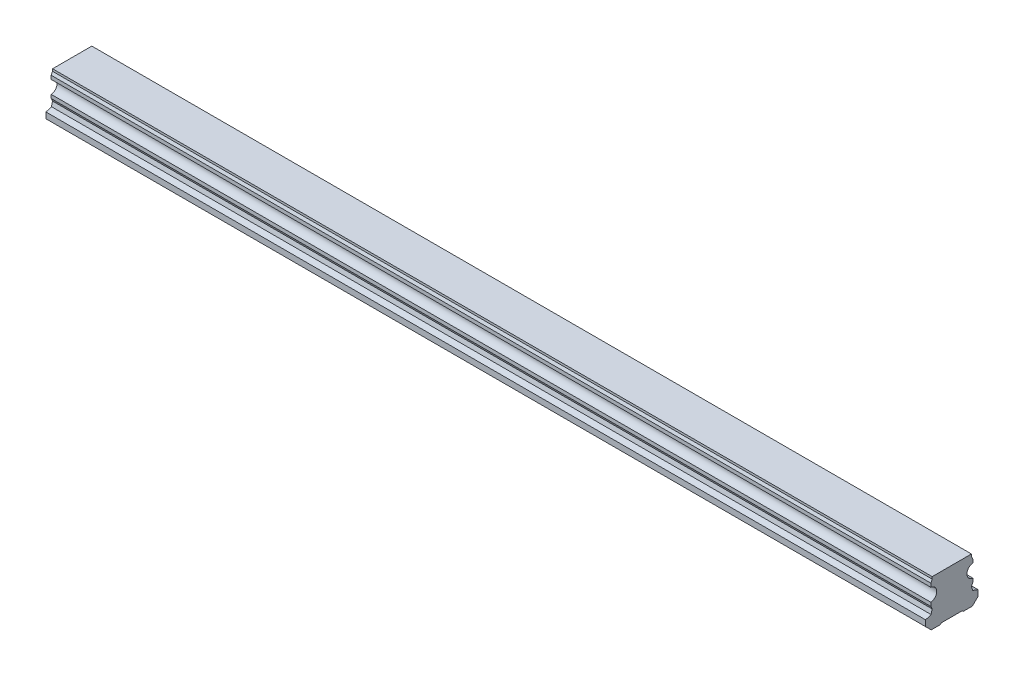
from build123d import *

# Parameters (mm, degrees)
BOSS_EXTRUDE1_DEPTH        = 420
SKETCH3_R                  = 3
SKETCH3_R_2                = 2.5
CUT_EXTRUDE3_DEPTH         = 12
SKETCH3_2_R                = 2.5
CUT_EXTRUDE4_DEPTH         = 15
CHAMFER1_SIZE              = 0.5
LPATTERN4_COUNT            = 7
LPATTERN4_PITCH            = 60
CHAMFER1_OF_LPATTERN4_SIZE = 0.5


with BuildPart() as part:
    # Sketch1 → Boss-Extrude1 (new body)
    with BuildSketch(Plane(origin=(0, 0, 0), x_dir=(0, 0, -1), z_dir=(1, 0, 0))):
        with BuildLine():
            Line((9.375, 21.8), (-9.375, 21.8))
            Line((-9.375, 21.8), (-9.375, 20.756))
            Line((-9.375, 20.756), (-10, 19.415683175))
            Line((-10, 19.415683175), (-10, 17.685449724))
            ThreePointArc((-10, 17.685449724), (-7.2, 14.6), (-10, 11.514550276))
            Line((-10, 11.514550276), (-10, 9.784316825))
            Line((-10, 9.784316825), (-9.375, 8.444))
            Line((-9.375, 8.444), (-9.922688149, 6.4))
            Line((-9.922688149, 6.4), (-12.5, 5.489338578))
            Line((-12.5, 5.489338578), (-12.5, 2.65))
            Line((-12.5, 2.65), (-9.85, 0))
            Line((-9.85, 0), (-5.5, 0))
            Line((-5.5, 0), (-5, 0.5))
            Line((-5, 0.5), (5, 0.5))
            Line((5, 0.5), (5.5, 0))
            Line((5.5, 0), (9.85, 0))
            Line((9.85, 0), (12.5, 2.65))
            Line((12.5, 2.65), (12.5, 5.489338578))
            Line((12.5, 5.489338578), (9.922688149, 6.4))
            Line((9.922688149, 6.4), (9.375, 8.444))
            Line((9.375, 8.444), (10, 9.784316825))
            Line((10, 9.784316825), (10, 11.514550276))
            ThreePointArc((10, 11.514550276), (7.2, 14.6), (10, 17.685449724))
            Line((10, 17.685449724), (10, 19.415683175))
            Line((10, 19.415683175), (9.375, 20.756))
            Line((9.375, 20.756), (9.375, 21.8))
        make_face()
    extrude(amount=BOSS_EXTRUDE1_DEPTH)

    # Sketch3 → Cut-Extrude3 (cut)
    with BuildSketch(Plane.XZ):
        with Locations(Location((30, 0, 0), (0, 0, 270))):
            Circle(SKETCH3_R)
        with Locations(Location((30, 0, 0), (0, 0, 270))):
            Circle(SKETCH3_R_2, mode=Mode.SUBTRACT)
    cut_extrude3 = extrude(amount=-CUT_EXTRUDE3_DEPTH, mode=Mode.SUBTRACT)

    # Sketch3_2 → Cut-Extrude4 (cut)
    with BuildSketch(Plane.XZ):
        with Locations(Location((30, 0, 0), (0, 0, 270))):
            Circle(SKETCH3_2_R)
    cut_extrude4 = extrude(amount=-CUT_EXTRUDE4_DEPTH, mode=Mode.SUBTRACT)

    # Cut-Extrude5 cone 1 section (on through the dimple's axis) → Cut-Extrude5 (revolve, cut)
    with BuildSketch(Plane(origin=(30, 15, 0), x_dir=(0, 0, -1), z_dir=(1, 0, 0))):
        Polygon((0, 0), (2.5, 0), (0, 1.443375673), align=None)
    cut_extrude5 = revolve(axis=Axis((30, 15, 0), (0, 1, 0)), mode=Mode.SUBTRACT)

    # Chamfer1
    chamfer1_edges = [part.edges().sort_by_distance(p)[0] for p in [
        (30, 0.5, 3),
    ]]
    chamfer(chamfer1_edges, length=CHAMFER1_SIZE)

    # LPattern4: Cut-Extrude3, Cut-Extrude4, Cut-Extrude5 ×7
    with Locations(*[(i * LPATTERN4_PITCH, 0, 0) for i in range(1, LPATTERN4_COUNT)]):
        add(cut_extrude3, mode=Mode.SUBTRACT)
        add(cut_extrude4, mode=Mode.SUBTRACT)
        add(cut_extrude5, mode=Mode.SUBTRACT)

    # Chamfer1 of LPattern4
    chamfer1_of_lpattern4_edges = [part.edges().sort_by_distance(p)[0] for p in [
        (90, 0.5, 3),
        (150, 0.5, 3),
        (210, 0.5, 3),
        (270, 0.5, 3),
        (330, 0.5, 3),
        (390, 0.5, 3),
    ]]
    chamfer(chamfer1_of_lpattern4_edges, length=CHAMFER1_OF_LPATTERN4_SIZE)


solid = part.part
